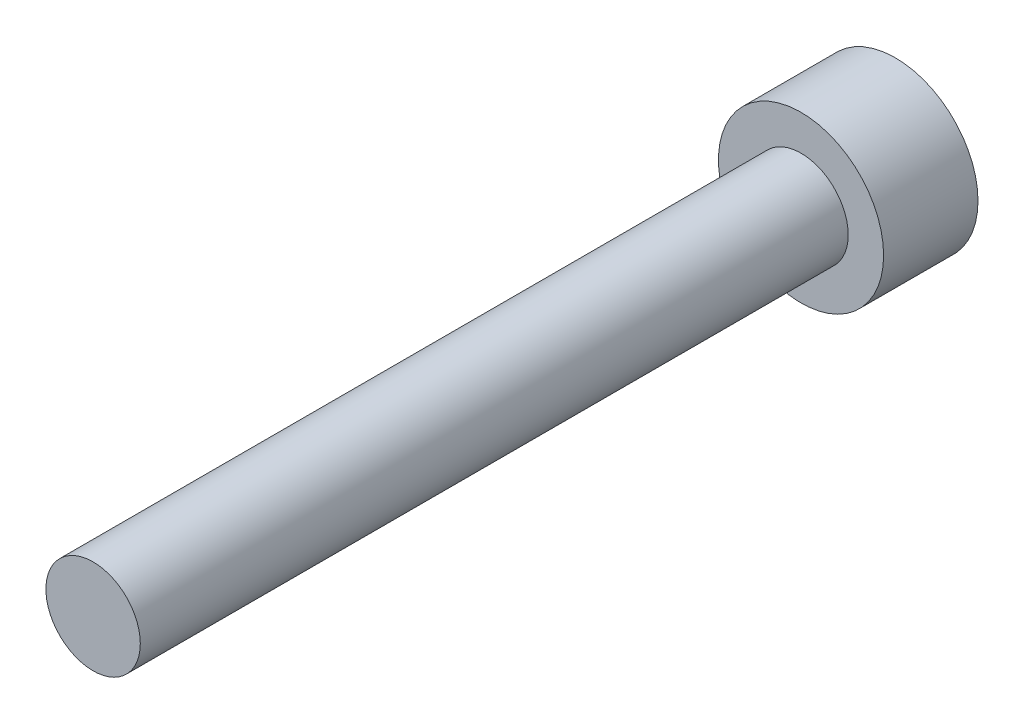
ISO-10303-21;
HEADER;
FILE_DESCRIPTION(('STEP AP214'),'2;1');
FILE_NAME('part.step','',(''),(''),'','','');
FILE_SCHEMA(('AUTOMOTIVE_DESIGN { 1 0 10303 214 1 1 1 1 }'));
ENDSEC;
DATA;
#1=APPLICATION_CONTEXT('core data for automotive mechanical design processes');
#2=APPLICATION_PROTOCOL_DEFINITION('international standard','automotive_design',2000,#1);
#3=PRODUCT_CONTEXT('',#1,'mechanical');
#4=PRODUCT('Part','Part','',(#3));
#5=PRODUCT_RELATED_PRODUCT_CATEGORY('part','',(#4));
#6=PRODUCT_DEFINITION_FORMATION('','',#4);
#7=PRODUCT_DEFINITION_CONTEXT('part definition',#1,'design');
#8=PRODUCT_DEFINITION('design','',#6,#7);
#9=PRODUCT_DEFINITION_SHAPE('','',#8);
#10=(LENGTH_UNIT() NAMED_UNIT(*) SI_UNIT(.MILLI.,.METRE.));
#11=(NAMED_UNIT(*) PLANE_ANGLE_UNIT() SI_UNIT($,.RADIAN.));
#12=(NAMED_UNIT(*) SI_UNIT($,.STERADIAN.) SOLID_ANGLE_UNIT());
#13=UNCERTAINTY_MEASURE_WITH_UNIT(LENGTH_MEASURE(1.E-05),#10,'distance_accuracy_value','');
#14=(GEOMETRIC_REPRESENTATION_CONTEXT(3) GLOBAL_UNCERTAINTY_ASSIGNED_CONTEXT((#13)) GLOBAL_UNIT_ASSIGNED_CONTEXT((#10,
#11,#12)) REPRESENTATION_CONTEXT('',''));
#15=CARTESIAN_POINT('',(0.,0.,0.));
#16=DIRECTION('',(0.,0.,1.));
#17=DIRECTION('',(1.,0.,0.));
#18=AXIS2_PLACEMENT_3D('',#15,#16,#17);
#19=CARTESIAN_POINT('',(0.,0.,0.));
#20=DIRECTION('',(0.,0.,-1.));
#21=DIRECTION('',(-1.,0.,0.));
#22=AXIS2_PLACEMENT_3D('',#19,#20,#21);
#23=CYLINDRICAL_SURFACE('',#22,3.5);
#24=CARTESIAN_POINT('',(0.,0.,0.));
#25=DIRECTION('',(0.,0.,1.));
#26=DIRECTION('',(1.,0.,0.));
#27=AXIS2_PLACEMENT_3D('',#24,#25,#26);
#28=CIRCLE('',#27,3.5);
#29=CARTESIAN_POINT('',(3.5,0.,0.));
#30=VERTEX_POINT('',#29);
#31=EDGE_CURVE('E48',#30,#30,#28,.T.);
#32=ORIENTED_EDGE('',*,*,#31,.F.);
#33=EDGE_LOOP('',(#32));
#34=FACE_BOUND('',#33,.T.);
#35=CARTESIAN_POINT('',(0.,0.,-4.));
#36=DIRECTION('',(0.,0.,1.));
#37=DIRECTION('',(1.,0.,0.));
#38=AXIS2_PLACEMENT_3D('',#35,#36,#37);
#39=CIRCLE('',#38,3.5);
#40=CARTESIAN_POINT('',(3.5,0.,-4.));
#41=VERTEX_POINT('',#40);
#42=EDGE_CURVE('E44',#41,#41,#39,.T.);
#43=ORIENTED_EDGE('',*,*,#42,.T.);
#44=EDGE_LOOP('',(#43));
#45=FACE_BOUND('',#44,.T.);
#46=ADVANCED_FACE('F41',(#34,#45),#23,.T.);
#47=CARTESIAN_POINT('',(0.,0.,0.));
#48=DIRECTION('',(0.,0.,1.));
#49=DIRECTION('',(1.,0.,0.));
#50=AXIS2_PLACEMENT_3D('',#47,#48,#49);
#51=PLANE('',#50);
#52=CARTESIAN_POINT('',(0.,0.,0.));
#53=DIRECTION('',(0.,0.,1.));
#54=DIRECTION('',(1.,0.,0.));
#55=AXIS2_PLACEMENT_3D('',#52,#53,#54);
#56=CIRCLE('',#55,2.);
#57=CARTESIAN_POINT('',(2.,0.,0.));
#58=VERTEX_POINT('',#57);
#59=EDGE_CURVE('E10',#58,#58,#56,.T.);
#60=ORIENTED_EDGE('',*,*,#59,.F.);
#61=EDGE_LOOP('',(#60));
#62=FACE_BOUND('',#61,.T.);
#63=ORIENTED_EDGE('',*,*,#31,.T.);
#64=EDGE_LOOP('',(#63));
#65=FACE_BOUND('',#64,.T.);
#66=ADVANCED_FACE('F65',(#62,#65),#51,.T.);
#67=CARTESIAN_POINT('',(0.,0.,-4.));
#68=DIRECTION('',(0.,0.,1.));
#69=DIRECTION('',(1.,0.,0.));
#70=AXIS2_PLACEMENT_3D('',#67,#68,#69);
#71=PLANE('',#70);
#72=ORIENTED_EDGE('',*,*,#42,.F.);
#73=EDGE_LOOP('',(#72));
#74=FACE_BOUND('',#73,.T.);
#75=ADVANCED_FACE('F62',(#74),#71,.F.);
#76=CARTESIAN_POINT('',(0.,0.,30.));
#77=DIRECTION('',(0.,0.,-1.));
#78=DIRECTION('',(-1.,0.,0.));
#79=AXIS2_PLACEMENT_3D('',#76,#77,#78);
#80=CYLINDRICAL_SURFACE('',#79,2.);
#81=CARTESIAN_POINT('',(0.,0.,30.));
#82=DIRECTION('',(0.,0.,1.));
#83=DIRECTION('',(1.,0.,0.));
#84=AXIS2_PLACEMENT_3D('',#81,#82,#83);
#85=CIRCLE('',#84,2.);
#86=CARTESIAN_POINT('',(2.,0.,30.));
#87=VERTEX_POINT('',#86);
#88=EDGE_CURVE('E54',#87,#87,#85,.T.);
#89=ORIENTED_EDGE('',*,*,#88,.F.);
#90=EDGE_LOOP('',(#89));
#91=FACE_BOUND('',#90,.T.);
#92=ORIENTED_EDGE('',*,*,#59,.T.);
#93=EDGE_LOOP('',(#92));
#94=FACE_BOUND('',#93,.T.);
#95=ADVANCED_FACE('F64',(#91,#94),#80,.T.);
#96=CARTESIAN_POINT('',(0.,0.,30.));
#97=DIRECTION('',(0.,0.,1.));
#98=DIRECTION('',(1.,0.,0.));
#99=AXIS2_PLACEMENT_3D('',#96,#97,#98);
#100=PLANE('',#99);
#101=ORIENTED_EDGE('',*,*,#88,.T.);
#102=EDGE_LOOP('',(#101));
#103=FACE_BOUND('',#102,.T.);
#104=ADVANCED_FACE('F71',(#103),#100,.T.);
#105=CLOSED_SHELL('',(#46,#66,#75,#95,#104));
#106=MANIFOLD_SOLID_BREP('B2',#105);
#107=ADVANCED_BREP_SHAPE_REPRESENTATION('',(#18,#106),#14);
#108=SHAPE_DEFINITION_REPRESENTATION(#9,#107);
ENDSEC;
END-ISO-10303-21;
